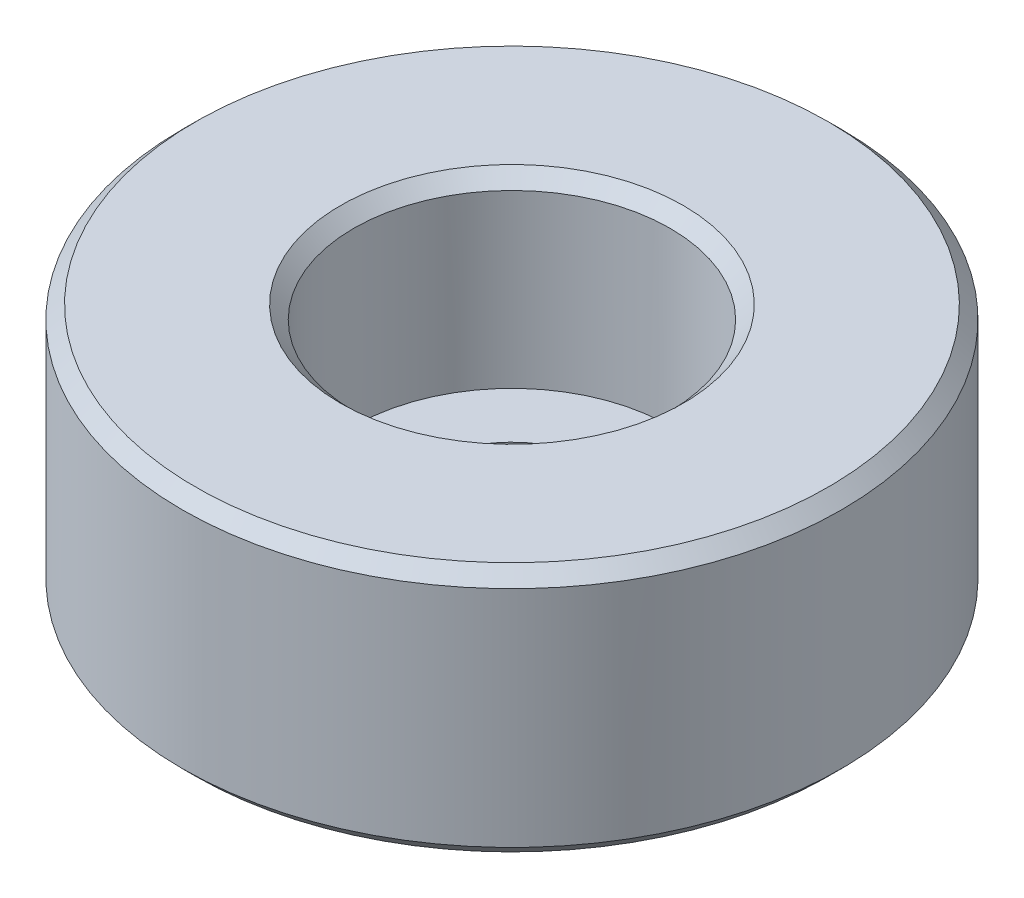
from build123d import *

# Parameters (mm, degrees)
CHANFREIN1_SIZE = 0.5


with BuildPart() as part:
    # Esquisse1 → Base-R_volution (revolve)
    with BuildSketch(Plane.XY, mode=Mode.PRIVATE) as base_r_volution_sk:
        Polygon((12.5, 0), (12.5, 9.5), (6, 9.5), (6, 2.5), (3.5, 2.5), (3.5, -4), (6, -4), (6, 0), align=None)
    revolve(base_r_volution_sk.sketch.rotate(Axis((0, 50, 0), (0, -1, 0)), 90), axis=Axis((0, 50, 0), (0, -1, 0)))

    # Chanfrein1
    chanfrein1_edges = [part.edges().sort_by_distance(p)[0] for p in [
        (0, 0, -12.5),
        (0, 9.5, -12.5),
        (0, 9.5, -6),
        (0, -4, -3.5),
        (0, -4, -6),
    ]]
    chamfer(chanfrein1_edges, length=CHANFREIN1_SIZE)


solid = part.part
